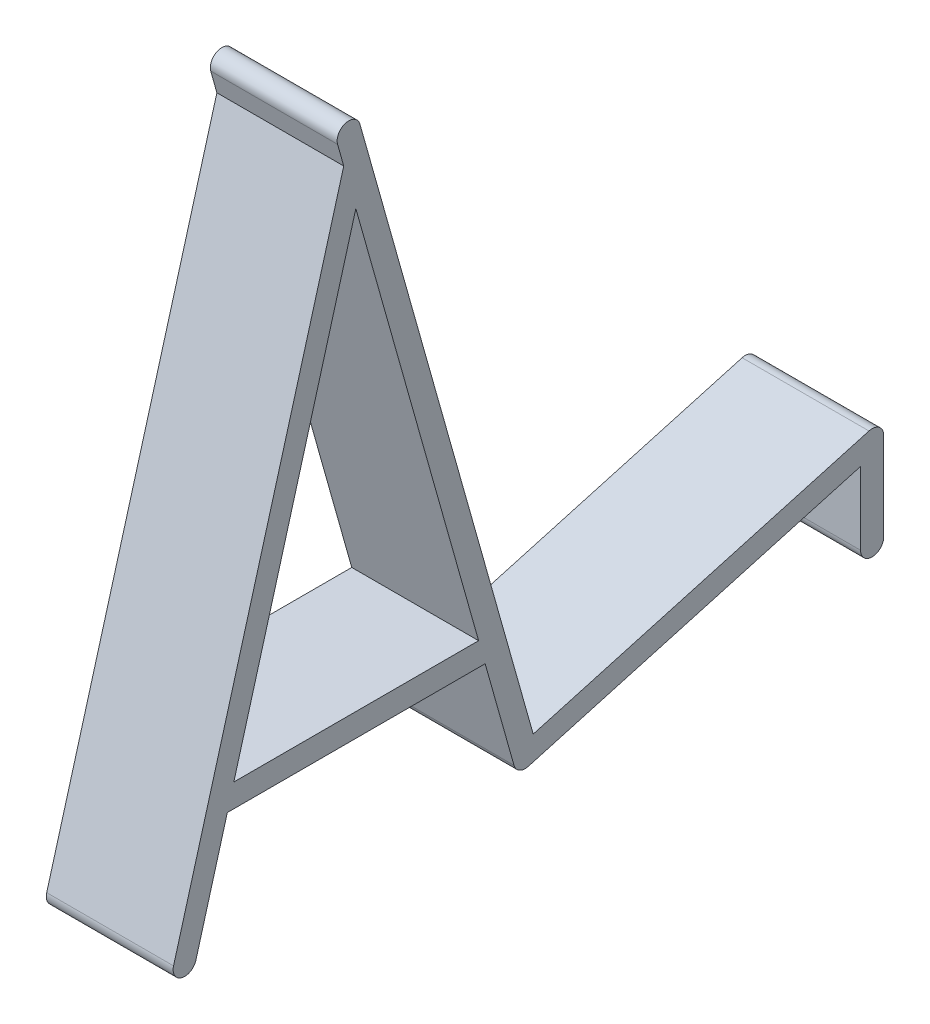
ISO-10303-21;
HEADER;
FILE_DESCRIPTION(('STEP AP214'),'2;1');
FILE_NAME('part.step','',(''),(''),'','','');
FILE_SCHEMA(('AUTOMOTIVE_DESIGN { 1 0 10303 214 1 1 1 1 }'));
ENDSEC;
DATA;
#1=APPLICATION_CONTEXT('core data for automotive mechanical design processes');
#2=APPLICATION_PROTOCOL_DEFINITION('international standard','automotive_design',2000,#1);
#3=PRODUCT_CONTEXT('',#1,'mechanical');
#4=PRODUCT('Part','Part','',(#3));
#5=PRODUCT_RELATED_PRODUCT_CATEGORY('part','',(#4));
#6=PRODUCT_DEFINITION_FORMATION('','',#4);
#7=PRODUCT_DEFINITION_CONTEXT('part definition',#1,'design');
#8=PRODUCT_DEFINITION('design','',#6,#7);
#9=PRODUCT_DEFINITION_SHAPE('','',#8);
#10=(LENGTH_UNIT() NAMED_UNIT(*) SI_UNIT(.MILLI.,.METRE.));
#11=(NAMED_UNIT(*) PLANE_ANGLE_UNIT() SI_UNIT($,.RADIAN.));
#12=(NAMED_UNIT(*) SI_UNIT($,.STERADIAN.) SOLID_ANGLE_UNIT());
#13=UNCERTAINTY_MEASURE_WITH_UNIT(LENGTH_MEASURE(1.E-05),#10,'distance_accuracy_value','');
#14=(GEOMETRIC_REPRESENTATION_CONTEXT(3) GLOBAL_UNCERTAINTY_ASSIGNED_CONTEXT((#13)) GLOBAL_UNIT_ASSIGNED_CONTEXT((#10,
#11,#12)) REPRESENTATION_CONTEXT('',''));
#15=CARTESIAN_POINT('',(0.,0.,0.));
#16=DIRECTION('',(0.,0.,1.));
#17=DIRECTION('',(1.,0.,0.));
#18=AXIS2_PLACEMENT_3D('',#15,#16,#17);
#19=CARTESIAN_POINT('',(25.4,129.495291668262,78.9195822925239));
#20=DIRECTION('',(0.,0.271266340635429,-0.962504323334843));
#21=DIRECTION('',(0.,0.962504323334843,0.271266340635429));
#22=AXIS2_PLACEMENT_3D('',#19,#20,#21);
#23=PLANE('',#22);
#24=DIRECTION('',(0.,-0.962504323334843,-0.271266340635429));
#25=VECTOR('',#24,1.);
#26=CARTESIAN_POINT('',(25.4,129.495291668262,78.9195822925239));
#27=LINE('',#26,#25);
#28=CARTESIAN_POINT('',(25.4,129.495291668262,78.9195822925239));
#29=VERTEX_POINT('',#28);
#30=CARTESIAN_POINT('',(25.4,6.37261149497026,44.2194380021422));
#31=VERTEX_POINT('',#30);
#32=EDGE_CURVE('E302',#29,#31,#27,.T.);
#33=ORIENTED_EDGE('',*,*,#32,.T.);
#34=DIRECTION('',(1.,0.,0.));
#35=VECTOR('',#34,1.);
#36=CARTESIAN_POINT('',(25.4,6.37261149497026,44.2194380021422));
#37=LINE('',#36,#35);
#38=CARTESIAN_POINT('',(0.,6.37261149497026,44.2194380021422));
#39=VERTEX_POINT('',#38);
#40=EDGE_CURVE('E324',#39,#31,#37,.T.);
#41=ORIENTED_EDGE('',*,*,#40,.F.);
#42=DIRECTION('',(0.,-0.962504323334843,-0.271266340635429));
#43=VECTOR('',#42,1.);
#44=CARTESIAN_POINT('',(0.,129.495291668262,78.9195822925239));
#45=LINE('',#44,#43);
#46=CARTESIAN_POINT('',(0.,129.495291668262,78.9195822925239));
#47=VERTEX_POINT('',#46);
#48=EDGE_CURVE('E294',#47,#39,#45,.T.);
#49=ORIENTED_EDGE('',*,*,#48,.F.);
#50=DIRECTION('',(-1.,0.,0.));
#51=VECTOR('',#50,1.);
#52=CARTESIAN_POINT('',(25.4,129.495291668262,78.9195822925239));
#53=LINE('',#52,#51);
#54=EDGE_CURVE('E304',#29,#47,#53,.T.);
#55=ORIENTED_EDGE('',*,*,#54,.F.);
#56=EDGE_LOOP('',(#33,#41,#49,#55));
#57=FACE_BOUND('',#56,.T.);
#58=ADVANCED_FACE('F133',(#57),#23,.T.);
#59=CARTESIAN_POINT('',(25.4,128.864814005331,81.1566363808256));
#60=DIRECTION('',(-1.,0.,0.));
#61=DIRECTION('',(0.,0.,1.));
#62=AXIS2_PLACEMENT_3D('',#59,#60,#61);
#63=CYLINDRICAL_SURFACE('',#62,2.3242016);
#64=CARTESIAN_POINT('',(0.,128.864814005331,81.1566363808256));
#65=DIRECTION('',(1.,0.,0.));
#66=DIRECTION('',(0.,0.,-1.));
#67=AXIS2_PLACEMENT_3D('',#64,#65,#66);
#68=CIRCLE('',#67,2.3242016);
#69=CARTESIAN_POINT('',(0.,128.2343363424,83.3936904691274));
#70=VERTEX_POINT('',#69);
#71=EDGE_CURVE('E305',#47,#70,#68,.T.);
#72=ORIENTED_EDGE('',*,*,#71,.T.);
#73=DIRECTION('',(-1.,0.,0.));
#74=VECTOR('',#73,1.);
#75=CARTESIAN_POINT('',(25.4,128.2343363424,83.3936904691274));
#76=LINE('',#75,#74);
#77=CARTESIAN_POINT('',(25.4,128.2343363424,83.3936904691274));
#78=VERTEX_POINT('',#77);
#79=EDGE_CURVE('E321',#78,#70,#76,.T.);
#80=ORIENTED_EDGE('',*,*,#79,.F.);
#81=CARTESIAN_POINT('',(25.4,128.864814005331,81.1566363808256));
#82=DIRECTION('',(1.,0.,0.));
#83=DIRECTION('',(0.,0.,-1.));
#84=AXIS2_PLACEMENT_3D('',#81,#82,#83);
#85=CIRCLE('',#84,2.3242016);
#86=EDGE_CURVE('E290',#29,#78,#85,.T.);
#87=ORIENTED_EDGE('',*,*,#86,.F.);
#88=ORIENTED_EDGE('',*,*,#54,.T.);
#89=EDGE_LOOP('',(#72,#80,#87,#88));
#90=FACE_BOUND('',#89,.T.);
#91=ADVANCED_FACE('F407',(#90),#63,.T.);
#92=CARTESIAN_POINT('',(25.4,128.2343363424,83.3936904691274));
#93=DIRECTION('',(0.,0.271266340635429,-0.962504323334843));
#94=DIRECTION('',(0.,0.962504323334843,0.271266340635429));
#95=AXIS2_PLACEMENT_3D('',#92,#93,#94);
#96=PLANE('',#95);
#97=DIRECTION('',(0.,-0.962504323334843,-0.271266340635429));
#98=VECTOR('',#97,1.);
#99=CARTESIAN_POINT('',(0.,128.2343363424,83.3936904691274));
#100=LINE('',#99,#98);
#101=CARTESIAN_POINT('',(0.,123.853706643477,82.1590805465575));
#102=VERTEX_POINT('',#101);
#103=EDGE_CURVE('E310',#70,#102,#100,.T.);
#104=ORIENTED_EDGE('',*,*,#103,.T.);
#105=DIRECTION('',(1.,0.,0.));
#106=VECTOR('',#105,1.);
#107=CARTESIAN_POINT('',(25.4,123.853706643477,82.1590805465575));
#108=LINE('',#107,#106);
#109=CARTESIAN_POINT('',(25.4,123.853706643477,82.1590805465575));
#110=VERTEX_POINT('',#109);
#111=EDGE_CURVE('E380',#102,#110,#108,.T.);
#112=ORIENTED_EDGE('',*,*,#111,.T.);
#113=DIRECTION('',(0.,-0.962504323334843,-0.271266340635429));
#114=VECTOR('',#113,1.);
#115=CARTESIAN_POINT('',(25.4,128.2343363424,83.3936904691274));
#116=LINE('',#115,#114);
#117=EDGE_CURVE('E295',#78,#110,#116,.T.);
#118=ORIENTED_EDGE('',*,*,#117,.F.);
#119=ORIENTED_EDGE('',*,*,#79,.T.);
#120=EDGE_LOOP('',(#104,#112,#118,#119));
#121=FACE_BOUND('',#120,.T.);
#122=ADVANCED_FACE('F409',(#121),#96,.F.);
#123=CARTESIAN_POINT('',(25.4,128.864814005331,81.1566363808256));
#124=DIRECTION('',(1.,0.,0.));
#125=DIRECTION('',(0.,0.,-1.));
#126=AXIS2_PLACEMENT_3D('',#123,#124,#125);
#127=PLANE('',#126);
#128=DIRECTION('',(0.,0.271266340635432,-0.962504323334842));
#129=VECTOR('',#128,1.);
#130=CARTESIAN_POINT('',(25.4,1.26802565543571,45.1955367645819));
#131=LINE('',#130,#129);
#132=CARTESIAN_POINT('',(25.4,1.26802565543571,45.1955367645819));
#133=VERTEX_POINT('',#132);
#134=CARTESIAN_POINT('',(25.4,20.0137570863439,-21.3178666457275));
#135=VERTEX_POINT('',#134);
#136=EDGE_CURVE('E328',#133,#135,#131,.T.);
#137=ORIENTED_EDGE('',*,*,#136,.T.);
#138=DIRECTION('',(0.,1.,0.));
#139=VECTOR('',#138,1.);
#140=CARTESIAN_POINT('',(25.4,23.0835113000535,-21.3178666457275));
#141=LINE('',#140,#139);
#142=CARTESIAN_POINT('',(25.4,5.48409220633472,-21.3178666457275));
#143=VERTEX_POINT('',#142);
#144=EDGE_CURVE('E275',#143,#135,#141,.T.);
#145=ORIENTED_EDGE('',*,*,#144,.F.);
#146=CARTESIAN_POINT('',(25.4,5.48409220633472,-23.6419666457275));
#147=DIRECTION('',(-1.,0.,0.));
#148=DIRECTION('',(0.,0.,1.));
#149=AXIS2_PLACEMENT_3D('',#146,#147,#148);
#150=CIRCLE('',#149,2.3241);
#151=CARTESIAN_POINT('',(25.4,5.48409220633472,-25.9660666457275));
#152=VERTEX_POINT('',#151);
#153=EDGE_CURVE('E265',#152,#143,#150,.T.);
#154=ORIENTED_EDGE('',*,*,#153,.F.);
#155=DIRECTION('',(0.,-1.,0.));
#156=VECTOR('',#155,1.);
#157=CARTESIAN_POINT('',(25.4,23.0835113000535,-25.9660666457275));
#158=LINE('',#157,#156);
#159=CARTESIAN_POINT('',(25.4,23.0617795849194,-25.9660666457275));
#160=VERTEX_POINT('',#159);
#161=EDGE_CURVE('E256',#160,#152,#158,.T.);
#162=ORIENTED_EDGE('',*,*,#161,.F.);
#163=CARTESIAN_POINT('',(25.4,23.0835113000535,-23.6419666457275));
#164=DIRECTION('',(1.,0.,0.));
#165=DIRECTION('',(0.,0.,-1.));
#166=AXIS2_PLACEMENT_3D('',#163,#164,#165);
#167=CIRCLE('',#166,2.32420160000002);
#168=CARTESIAN_POINT('',(25.4,25.3205653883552,-23.0114889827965));
#169=VERTEX_POINT('',#168);
#170=EDGE_CURVE('E330',#160,#169,#167,.T.);
#171=ORIENTED_EDGE('',*,*,#170,.T.);
#172=DIRECTION('',(0.,0.271266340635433,-0.962504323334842));
#173=VECTOR('',#172,1.);
#174=CARTESIAN_POINT('',(25.4,5.74213383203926,46.456492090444));
#175=LINE('',#174,#173);
#176=EDGE_CURVE('E333',#31,#169,#175,.T.);
#177=ORIENTED_EDGE('',*,*,#176,.F.);
#178=ORIENTED_EDGE('',*,*,#32,.F.);
#179=ORIENTED_EDGE('',*,*,#86,.T.);
#180=ORIENTED_EDGE('',*,*,#117,.T.);
#181=DIRECTION('',(0.,0.962935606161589,-0.269731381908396));
#182=VECTOR('',#181,1.);
#183=CARTESIAN_POINT('',(25.4,2.18971936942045,116.238820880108));
#184=LINE('',#183,#182);
#185=CARTESIAN_POINT('',(25.4,2.18971936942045,116.238820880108));
#186=VERTEX_POINT('',#185);
#187=EDGE_CURVE('E362',#186,#110,#184,.T.);
#188=ORIENTED_EDGE('',*,*,#187,.F.);
#189=CARTESIAN_POINT('',(25.4,1.56280926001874,114.00076440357));
#190=DIRECTION('',(1.,0.,0.));
#191=DIRECTION('',(0.,0.,-1.));
#192=AXIS2_PLACEMENT_3D('',#189,#190,#191);
#193=CIRCLE('',#192,2.32420160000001);
#194=CARTESIAN_POINT('',(25.4,0.935899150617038,111.762707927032));
#195=VERTEX_POINT('',#194);
#196=EDGE_CURVE('E354',#186,#195,#193,.T.);
#197=ORIENTED_EDGE('',*,*,#196,.T.);
#198=DIRECTION('',(0.,0.962935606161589,-0.269731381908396));
#199=VECTOR('',#198,1.);
#200=CARTESIAN_POINT('',(25.4,0.935899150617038,111.762707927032));
#201=LINE('',#200,#199);
#202=CARTESIAN_POINT('',(25.4,23.3890401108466,105.47327725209));
#203=VERTEX_POINT('',#202);
#204=EDGE_CURVE('E359',#195,#203,#201,.T.);
#205=ORIENTED_EDGE('',*,*,#204,.T.);
#206=DIRECTION('',(0.,0.,1.));
#207=VECTOR('',#206,1.);
#208=CARTESIAN_POINT('',(25.4,23.3890401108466,52.0850271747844));
#209=LINE('',#208,#207);
#210=CARTESIAN_POINT('',(25.4,23.3890401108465,53.844732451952));
#211=VERTEX_POINT('',#210);
#212=EDGE_CURVE('E346',#211,#203,#209,.T.);
#213=ORIENTED_EDGE('',*,*,#212,.F.);
#214=CARTESIAN_POINT('',(25.4,2.87460208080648,48.0630685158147));
#215=VERTEX_POINT('',#214);
#216=EDGE_CURVE('E293',#211,#215,#116,.T.);
#217=ORIENTED_EDGE('',*,*,#216,.T.);
#218=CARTESIAN_POINT('',(25.4,3.50507974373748,45.826014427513));
#219=DIRECTION('',(1.,0.,0.));
#220=DIRECTION('',(0.,0.,-1.));
#221=AXIS2_PLACEMENT_3D('',#218,#219,#220);
#222=CIRCLE('',#221,2.32420159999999);
#223=EDGE_CURVE('E298',#215,#133,#222,.T.);
#224=ORIENTED_EDGE('',*,*,#223,.T.);
#225=EDGE_LOOP('',(#137,#145,#154,#162,#171,#177,#178,#179,#180,#188,#197,#205,#213,#217,#224));
#226=FACE_BOUND('',#225,.T.);
#227=DIRECTION('',(0.,0.,1.));
#228=VECTOR('',#227,1.);
#229=CARTESIAN_POINT('',(25.4,28.0374433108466,52.0850271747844));
#230=LINE('',#229,#228);
#231=CARTESIAN_POINT('',(25.4,28.0374433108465,55.1548100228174));
#232=VERTEX_POINT('',#231);
#233=CARTESIAN_POINT('',(25.4,28.0374433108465,104.171196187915));
#234=VERTEX_POINT('',#233);
#235=EDGE_CURVE('E344',#232,#234,#230,.T.);
#236=ORIENTED_EDGE('',*,*,#235,.T.);
#237=CARTESIAN_POINT('',(25.4,115.263358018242,79.7380291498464));
#238=VERTEX_POINT('',#237);
#239=EDGE_CURVE('E357',#234,#238,#201,.T.);
#240=ORIENTED_EDGE('',*,*,#239,.T.);
#241=EDGE_CURVE('E299',#238,#232,#116,.T.);
#242=ORIENTED_EDGE('',*,*,#241,.T.);
#243=EDGE_LOOP('',(#236,#240,#242));
#244=FACE_BOUND('',#243,.T.);
#245=ADVANCED_FACE('F277',(#226,#244),#127,.T.);
#246=CARTESIAN_POINT('',(25.4,3.50507974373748,45.826014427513));
#247=DIRECTION('',(-1.,0.,0.));
#248=DIRECTION('',(0.,0.,1.));
#249=AXIS2_PLACEMENT_3D('',#246,#247,#248);
#250=CYLINDRICAL_SURFACE('',#249,2.32420159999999);
#251=DIRECTION('',(-1.,0.,0.));
#252=VECTOR('',#251,1.);
#253=CARTESIAN_POINT('',(25.4,1.26802565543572,45.195536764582));
#254=LINE('',#253,#252);
#255=CARTESIAN_POINT('',(0.,1.26802565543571,45.1955367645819));
#256=VERTEX_POINT('',#255);
#257=EDGE_CURVE('E325',#133,#256,#254,.T.);
#258=ORIENTED_EDGE('',*,*,#257,.F.);
#259=ORIENTED_EDGE('',*,*,#223,.F.);
#260=DIRECTION('',(-1.,0.,0.));
#261=VECTOR('',#260,1.);
#262=CARTESIAN_POINT('',(25.4,2.87460208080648,48.0630685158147));
#263=LINE('',#262,#261);
#264=CARTESIAN_POINT('',(0.,2.87460208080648,48.0630685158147));
#265=VERTEX_POINT('',#264);
#266=EDGE_CURVE('E319',#215,#265,#263,.T.);
#267=ORIENTED_EDGE('',*,*,#266,.T.);
#268=CARTESIAN_POINT('',(0.,3.50507974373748,45.826014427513));
#269=DIRECTION('',(1.,0.,0.));
#270=DIRECTION('',(0.,0.,-1.));
#271=AXIS2_PLACEMENT_3D('',#268,#269,#270);
#272=CIRCLE('',#271,2.32420159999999);
#273=EDGE_CURVE('E313',#265,#256,#272,.T.);
#274=ORIENTED_EDGE('',*,*,#273,.T.);
#275=EDGE_LOOP('',(#258,#259,#267,#274));
#276=FACE_BOUND('',#275,.T.);
#277=ADVANCED_FACE('F451',(#276),#250,.T.);
#278=ORIENTED_EDGE('',*,*,#216,.F.);
#279=DIRECTION('',(-1.,0.,0.));
#280=VECTOR('',#279,1.);
#281=CARTESIAN_POINT('',(25.4,23.3890401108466,53.844732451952));
#282=LINE('',#281,#280);
#283=CARTESIAN_POINT('',(0.,23.3890401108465,53.844732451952));
#284=VERTEX_POINT('',#283);
#285=EDGE_CURVE('E385',#211,#284,#282,.T.);
#286=ORIENTED_EDGE('',*,*,#285,.T.);
#287=EDGE_CURVE('E308',#284,#265,#100,.T.);
#288=ORIENTED_EDGE('',*,*,#287,.T.);
#289=ORIENTED_EDGE('',*,*,#266,.F.);
#290=EDGE_LOOP('',(#278,#286,#288,#289));
#291=FACE_BOUND('',#290,.T.);
#292=ADVANCED_FACE('F428',(#291),#96,.F.);
#293=CARTESIAN_POINT('',(0.,128.864814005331,81.1566363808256));
#294=DIRECTION('',(1.,0.,0.));
#295=DIRECTION('',(0.,0.,-1.));
#296=AXIS2_PLACEMENT_3D('',#293,#294,#295);
#297=PLANE('',#296);
#298=DIRECTION('',(0.,1.,0.));
#299=VECTOR('',#298,1.);
#300=CARTESIAN_POINT('',(0.,23.0835113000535,-21.3178666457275));
#301=LINE('',#300,#299);
#302=CARTESIAN_POINT('',(0.,5.48409220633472,-21.3178666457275));
#303=VERTEX_POINT('',#302);
#304=CARTESIAN_POINT('',(0.,20.0137570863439,-21.3178666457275));
#305=VERTEX_POINT('',#304);
#306=EDGE_CURVE('E266',#303,#305,#301,.T.);
#307=ORIENTED_EDGE('',*,*,#306,.T.);
#308=DIRECTION('',(0.,0.271266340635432,-0.962504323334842));
#309=VECTOR('',#308,1.);
#310=CARTESIAN_POINT('',(0.,1.26802565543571,45.1955367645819));
#311=LINE('',#310,#309);
#312=EDGE_CURVE('E151',#256,#305,#311,.T.);
#313=ORIENTED_EDGE('',*,*,#312,.F.);
#314=ORIENTED_EDGE('',*,*,#273,.F.);
#315=ORIENTED_EDGE('',*,*,#287,.F.);
#316=DIRECTION('',(0.,0.,1.));
#317=VECTOR('',#316,1.);
#318=CARTESIAN_POINT('',(0.,23.3890401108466,52.0850271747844));
#319=LINE('',#318,#317);
#320=CARTESIAN_POINT('',(0.,23.3890401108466,105.47327725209));
#321=VERTEX_POINT('',#320);
#322=EDGE_CURVE('E347',#284,#321,#319,.T.);
#323=ORIENTED_EDGE('',*,*,#322,.T.);
#324=DIRECTION('',(0.,0.962935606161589,-0.269731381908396));
#325=VECTOR('',#324,1.);
#326=CARTESIAN_POINT('',(0.,0.935899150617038,111.762707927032));
#327=LINE('',#326,#325);
#328=CARTESIAN_POINT('',(0.,0.935899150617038,111.762707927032));
#329=VERTEX_POINT('',#328);
#330=EDGE_CURVE('E368',#329,#321,#327,.T.);
#331=ORIENTED_EDGE('',*,*,#330,.F.);
#332=CARTESIAN_POINT('',(0.,1.56280926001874,114.00076440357));
#333=DIRECTION('',(1.,0.,0.));
#334=DIRECTION('',(0.,0.,-1.));
#335=AXIS2_PLACEMENT_3D('',#332,#333,#334);
#336=CIRCLE('',#335,2.32420160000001);
#337=CARTESIAN_POINT('',(0.,2.18971936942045,116.238820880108));
#338=VERTEX_POINT('',#337);
#339=EDGE_CURVE('E288',#338,#329,#336,.T.);
#340=ORIENTED_EDGE('',*,*,#339,.F.);
#341=DIRECTION('',(0.,0.962935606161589,-0.269731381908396));
#342=VECTOR('',#341,1.);
#343=CARTESIAN_POINT('',(0.,2.18971936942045,116.238820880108));
#344=LINE('',#343,#342);
#345=EDGE_CURVE('E358',#338,#102,#344,.T.);
#346=ORIENTED_EDGE('',*,*,#345,.T.);
#347=ORIENTED_EDGE('',*,*,#103,.F.);
#348=ORIENTED_EDGE('',*,*,#71,.F.);
#349=ORIENTED_EDGE('',*,*,#48,.T.);
#350=DIRECTION('',(0.,0.271266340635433,-0.962504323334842));
#351=VECTOR('',#350,1.);
#352=CARTESIAN_POINT('',(0.,5.74213383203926,46.456492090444));
#353=LINE('',#352,#351);
#354=CARTESIAN_POINT('',(0.,25.3205653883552,-23.0114889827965));
#355=VERTEX_POINT('',#354);
#356=EDGE_CURVE('E331',#39,#355,#353,.T.);
#357=ORIENTED_EDGE('',*,*,#356,.T.);
#358=CARTESIAN_POINT('',(0.,23.0835113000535,-23.6419666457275));
#359=DIRECTION('',(1.,0.,0.));
#360=DIRECTION('',(0.,0.,-1.));
#361=AXIS2_PLACEMENT_3D('',#358,#359,#360);
#362=CIRCLE('',#361,2.32420160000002);
#363=CARTESIAN_POINT('',(0.,23.0617795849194,-25.9660666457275));
#364=VERTEX_POINT('',#363);
#365=EDGE_CURVE('E337',#364,#355,#362,.T.);
#366=ORIENTED_EDGE('',*,*,#365,.F.);
#367=DIRECTION('',(0.,-1.,0.));
#368=VECTOR('',#367,1.);
#369=CARTESIAN_POINT('',(0.,23.0835113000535,-25.9660666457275));
#370=LINE('',#369,#368);
#371=CARTESIAN_POINT('',(0.,5.48409220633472,-25.9660666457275));
#372=VERTEX_POINT('',#371);
#373=EDGE_CURVE('E283',#364,#372,#370,.T.);
#374=ORIENTED_EDGE('',*,*,#373,.T.);
#375=CARTESIAN_POINT('',(0.,5.48409220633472,-23.6419666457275));
#376=DIRECTION('',(-1.,0.,0.));
#377=DIRECTION('',(0.,0.,1.));
#378=AXIS2_PLACEMENT_3D('',#375,#376,#377);
#379=CIRCLE('',#378,2.3241);
#380=EDGE_CURVE('E273',#372,#303,#379,.T.);
#381=ORIENTED_EDGE('',*,*,#380,.T.);
#382=EDGE_LOOP('',(#307,#313,#314,#315,#323,#331,#340,#346,#347,#348,#349,#357,#366,#374,#381));
#383=FACE_BOUND('',#382,.T.);
#384=CARTESIAN_POINT('',(0.,28.0374433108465,104.171196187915));
#385=VERTEX_POINT('',#384);
#386=CARTESIAN_POINT('',(0.,115.263358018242,79.7380291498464));
#387=VERTEX_POINT('',#386);
#388=EDGE_CURVE('E367',#385,#387,#327,.T.);
#389=ORIENTED_EDGE('',*,*,#388,.F.);
#390=DIRECTION('',(0.,0.,1.));
#391=VECTOR('',#390,1.);
#392=CARTESIAN_POINT('',(0.,28.0374433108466,52.0850271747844));
#393=LINE('',#392,#391);
#394=CARTESIAN_POINT('',(0.,28.0374433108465,55.1548100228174));
#395=VERTEX_POINT('',#394);
#396=EDGE_CURVE('E350',#395,#385,#393,.T.);
#397=ORIENTED_EDGE('',*,*,#396,.F.);
#398=EDGE_CURVE('E314',#387,#395,#100,.T.);
#399=ORIENTED_EDGE('',*,*,#398,.F.);
#400=EDGE_LOOP('',(#389,#397,#399));
#401=FACE_BOUND('',#400,.T.);
#402=ADVANCED_FACE('F392',(#383,#401),#297,.F.);
#403=CARTESIAN_POINT('',(25.4,1.26802565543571,45.1955367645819));
#404=DIRECTION('',(0.,0.962504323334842,0.271266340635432));
#405=DIRECTION('',(0.,-0.271266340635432,0.962504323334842));
#406=AXIS2_PLACEMENT_3D('',#403,#404,#405);
#407=PLANE('',#406);
#408=ORIENTED_EDGE('',*,*,#312,.T.);
#409=DIRECTION('',(1.,0.,0.));
#410=VECTOR('',#409,1.);
#411=CARTESIAN_POINT('',(25.4,20.0137570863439,-21.3178666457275));
#412=LINE('',#411,#410);
#413=EDGE_CURVE('E12',#305,#135,#412,.T.);
#414=ORIENTED_EDGE('',*,*,#413,.T.);
#415=ORIENTED_EDGE('',*,*,#136,.F.);
#416=ORIENTED_EDGE('',*,*,#257,.T.);
#417=EDGE_LOOP('',(#408,#414,#415,#416));
#418=FACE_BOUND('',#417,.T.);
#419=ADVANCED_FACE('F477',(#418),#407,.F.);
#420=CARTESIAN_POINT('',(25.4,23.0835113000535,-23.6419666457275));
#421=DIRECTION('',(-1.,0.,0.));
#422=DIRECTION('',(0.,0.,1.));
#423=AXIS2_PLACEMENT_3D('',#420,#421,#422);
#424=CYLINDRICAL_SURFACE('',#423,2.32420160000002);
#425=ORIENTED_EDGE('',*,*,#170,.F.);
#426=DIRECTION('',(-1.,0.,0.));
#427=VECTOR('',#426,1.);
#428=CARTESIAN_POINT('',(25.4,23.0617795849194,-25.9660666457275));
#429=LINE('',#428,#427);
#430=EDGE_CURVE('E141',#160,#364,#429,.T.);
#431=ORIENTED_EDGE('',*,*,#430,.T.);
#432=ORIENTED_EDGE('',*,*,#365,.T.);
#433=DIRECTION('',(-1.,0.,0.));
#434=VECTOR('',#433,1.);
#435=CARTESIAN_POINT('',(25.4,25.3205653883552,-23.0114889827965));
#436=LINE('',#435,#434);
#437=EDGE_CURVE('E309',#169,#355,#436,.T.);
#438=ORIENTED_EDGE('',*,*,#437,.F.);
#439=EDGE_LOOP('',(#425,#431,#432,#438));
#440=FACE_BOUND('',#439,.T.);
#441=ADVANCED_FACE('F389',(#440),#424,.T.);
#442=CARTESIAN_POINT('',(25.4,5.74213383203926,46.456492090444));
#443=DIRECTION('',(0.,0.962504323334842,0.271266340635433));
#444=DIRECTION('',(0.,-0.271266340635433,0.962504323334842));
#445=AXIS2_PLACEMENT_3D('',#442,#443,#444);
#446=PLANE('',#445);
#447=ORIENTED_EDGE('',*,*,#356,.F.);
#448=ORIENTED_EDGE('',*,*,#40,.T.);
#449=ORIENTED_EDGE('',*,*,#176,.T.);
#450=ORIENTED_EDGE('',*,*,#437,.T.);
#451=EDGE_LOOP('',(#447,#448,#449,#450));
#452=FACE_BOUND('',#451,.T.);
#453=ADVANCED_FACE('F400',(#452),#446,.T.);
#454=DIRECTION('',(-1.,0.,0.));
#455=VECTOR('',#454,1.);
#456=CARTESIAN_POINT('',(25.4,28.0374433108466,55.1548100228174));
#457=LINE('',#456,#455);
#458=EDGE_CURVE('E383',#232,#395,#457,.T.);
#459=ORIENTED_EDGE('',*,*,#458,.F.);
#460=ORIENTED_EDGE('',*,*,#241,.F.);
#461=DIRECTION('',(1.,0.,0.));
#462=VECTOR('',#461,1.);
#463=CARTESIAN_POINT('',(25.4,115.263358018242,79.7380291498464));
#464=LINE('',#463,#462);
#465=EDGE_CURVE('E327',#387,#238,#464,.T.);
#466=ORIENTED_EDGE('',*,*,#465,.F.);
#467=ORIENTED_EDGE('',*,*,#398,.T.);
#468=EDGE_LOOP('',(#459,#460,#466,#467));
#469=FACE_BOUND('',#468,.T.);
#470=ADVANCED_FACE('F438',(#469),#96,.F.);
#471=CARTESIAN_POINT('',(25.4,1.56280926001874,114.00076440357));
#472=DIRECTION('',(-1.,0.,0.));
#473=DIRECTION('',(0.,0.,1.));
#474=AXIS2_PLACEMENT_3D('',#471,#472,#473);
#475=CYLINDRICAL_SURFACE('',#474,2.32420160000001);
#476=ORIENTED_EDGE('',*,*,#339,.T.);
#477=DIRECTION('',(-1.,0.,0.));
#478=VECTOR('',#477,1.);
#479=CARTESIAN_POINT('',(25.4,0.935899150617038,111.762707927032));
#480=LINE('',#479,#478);
#481=EDGE_CURVE('E352',#195,#329,#480,.T.);
#482=ORIENTED_EDGE('',*,*,#481,.F.);
#483=ORIENTED_EDGE('',*,*,#196,.F.);
#484=DIRECTION('',(-1.,0.,0.));
#485=VECTOR('',#484,1.);
#486=CARTESIAN_POINT('',(25.4,2.18971936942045,116.238820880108));
#487=LINE('',#486,#485);
#488=EDGE_CURVE('E364',#186,#338,#487,.T.);
#489=ORIENTED_EDGE('',*,*,#488,.T.);
#490=EDGE_LOOP('',(#476,#482,#483,#489));
#491=FACE_BOUND('',#490,.T.);
#492=ADVANCED_FACE('F135',(#491),#475,.T.);
#493=CARTESIAN_POINT('',(25.4,0.935899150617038,111.762707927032));
#494=DIRECTION('',(0.,0.269731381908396,0.962935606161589));
#495=DIRECTION('',(0.,-0.962935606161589,0.269731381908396));
#496=AXIS2_PLACEMENT_3D('',#493,#494,#495);
#497=PLANE('',#496);
#498=DIRECTION('',(-1.,0.,0.));
#499=VECTOR('',#498,1.);
#500=CARTESIAN_POINT('',(25.4,23.3890401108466,105.47327725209));
#501=LINE('',#500,#499);
#502=EDGE_CURVE('E349',#203,#321,#501,.T.);
#503=ORIENTED_EDGE('',*,*,#502,.F.);
#504=ORIENTED_EDGE('',*,*,#204,.F.);
#505=ORIENTED_EDGE('',*,*,#481,.T.);
#506=ORIENTED_EDGE('',*,*,#330,.T.);
#507=EDGE_LOOP('',(#503,#504,#505,#506));
#508=FACE_BOUND('',#507,.T.);
#509=ADVANCED_FACE('F421',(#508),#497,.F.);
#510=ORIENTED_EDGE('',*,*,#388,.T.);
#511=ORIENTED_EDGE('',*,*,#465,.T.);
#512=ORIENTED_EDGE('',*,*,#239,.F.);
#513=DIRECTION('',(-1.,0.,0.));
#514=VECTOR('',#513,1.);
#515=CARTESIAN_POINT('',(25.4,28.0374433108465,104.171196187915));
#516=LINE('',#515,#514);
#517=EDGE_CURVE('E338',#234,#385,#516,.T.);
#518=ORIENTED_EDGE('',*,*,#517,.T.);
#519=EDGE_LOOP('',(#510,#511,#512,#518));
#520=FACE_BOUND('',#519,.T.);
#521=ADVANCED_FACE('F447',(#520),#497,.F.);
#522=CARTESIAN_POINT('',(25.4,2.18971936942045,116.238820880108));
#523=DIRECTION('',(0.,0.269731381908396,0.962935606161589));
#524=DIRECTION('',(0.,-0.962935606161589,0.269731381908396));
#525=AXIS2_PLACEMENT_3D('',#522,#523,#524);
#526=PLANE('',#525);
#527=ORIENTED_EDGE('',*,*,#111,.F.);
#528=ORIENTED_EDGE('',*,*,#345,.F.);
#529=ORIENTED_EDGE('',*,*,#488,.F.);
#530=ORIENTED_EDGE('',*,*,#187,.T.);
#531=EDGE_LOOP('',(#527,#528,#529,#530));
#532=FACE_BOUND('',#531,.T.);
#533=ADVANCED_FACE('F415',(#532),#526,.T.);
#534=CARTESIAN_POINT('',(25.4,23.3890401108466,52.0850271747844));
#535=DIRECTION('',(0.,-1.,0.));
#536=DIRECTION('',(0.,0.,-1.));
#537=AXIS2_PLACEMENT_3D('',#534,#535,#536);
#538=PLANE('',#537);
#539=ORIENTED_EDGE('',*,*,#285,.F.);
#540=ORIENTED_EDGE('',*,*,#212,.T.);
#541=ORIENTED_EDGE('',*,*,#502,.T.);
#542=ORIENTED_EDGE('',*,*,#322,.F.);
#543=EDGE_LOOP('',(#539,#540,#541,#542));
#544=FACE_BOUND('',#543,.T.);
#545=ADVANCED_FACE('F461',(#544),#538,.T.);
#546=CARTESIAN_POINT('',(25.4,28.0374433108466,52.0850271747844));
#547=DIRECTION('',(0.,-1.,0.));
#548=DIRECTION('',(0.,0.,-1.));
#549=AXIS2_PLACEMENT_3D('',#546,#547,#548);
#550=PLANE('',#549);
#551=ORIENTED_EDGE('',*,*,#235,.F.);
#552=ORIENTED_EDGE('',*,*,#458,.T.);
#553=ORIENTED_EDGE('',*,*,#396,.T.);
#554=ORIENTED_EDGE('',*,*,#517,.F.);
#555=EDGE_LOOP('',(#551,#552,#553,#554));
#556=FACE_BOUND('',#555,.T.);
#557=ADVANCED_FACE('F444',(#556),#550,.F.);
#558=CARTESIAN_POINT('',(25.4,23.0835113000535,-21.3178666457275));
#559=DIRECTION('',(0.,0.,1.));
#560=DIRECTION('',(0.,-1.,0.));
#561=AXIS2_PLACEMENT_3D('',#558,#559,#560);
#562=PLANE('',#561);
#563=ORIENTED_EDGE('',*,*,#413,.F.);
#564=ORIENTED_EDGE('',*,*,#306,.F.);
#565=DIRECTION('',(-1.,0.,0.));
#566=VECTOR('',#565,1.);
#567=CARTESIAN_POINT('',(25.4,5.48409220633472,-21.3178666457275));
#568=LINE('',#567,#566);
#569=EDGE_CURVE('E274',#143,#303,#568,.T.);
#570=ORIENTED_EDGE('',*,*,#569,.F.);
#571=ORIENTED_EDGE('',*,*,#144,.T.);
#572=EDGE_LOOP('',(#563,#564,#570,#571));
#573=FACE_BOUND('',#572,.T.);
#574=ADVANCED_FACE('F453',(#573),#562,.T.);
#575=CARTESIAN_POINT('',(25.4,23.0835113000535,-25.9660666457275));
#576=DIRECTION('',(0.,0.,-1.));
#577=DIRECTION('',(-1.,0.,0.));
#578=AXIS2_PLACEMENT_3D('',#575,#576,#577);
#579=PLANE('',#578);
#580=ORIENTED_EDGE('',*,*,#430,.F.);
#581=ORIENTED_EDGE('',*,*,#161,.T.);
#582=DIRECTION('',(-1.,0.,0.));
#583=VECTOR('',#582,1.);
#584=CARTESIAN_POINT('',(25.4,5.48409220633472,-25.9660666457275));
#585=LINE('',#584,#583);
#586=EDGE_CURVE('E260',#152,#372,#585,.T.);
#587=ORIENTED_EDGE('',*,*,#586,.T.);
#588=ORIENTED_EDGE('',*,*,#373,.F.);
#589=EDGE_LOOP('',(#580,#581,#587,#588));
#590=FACE_BOUND('',#589,.T.);
#591=ADVANCED_FACE('F258',(#590),#579,.T.);
#592=CARTESIAN_POINT('',(25.4,5.48409220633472,-23.6419666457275));
#593=DIRECTION('',(-1.,0.,0.));
#594=DIRECTION('',(0.,0.,1.));
#595=AXIS2_PLACEMENT_3D('',#592,#593,#594);
#596=CYLINDRICAL_SURFACE('',#595,2.3241);
#597=ORIENTED_EDGE('',*,*,#380,.F.);
#598=ORIENTED_EDGE('',*,*,#586,.F.);
#599=ORIENTED_EDGE('',*,*,#153,.T.);
#600=ORIENTED_EDGE('',*,*,#569,.T.);
#601=EDGE_LOOP('',(#597,#598,#599,#600));
#602=FACE_BOUND('',#601,.T.);
#603=ADVANCED_FACE('F270',(#602),#596,.T.);
#604=CLOSED_SHELL('',(#58,#91,#122,#245,#277,#292,#402,#419,#441,#453,#470,#492,#509,#521,#533,
#545,#557,#574,#591,#603));
#605=MANIFOLD_SOLID_BREP('B2',#604);
#606=ADVANCED_BREP_SHAPE_REPRESENTATION('',(#18,#605),#14);
#607=SHAPE_DEFINITION_REPRESENTATION(#9,#606);
ENDSEC;
END-ISO-10303-21;
